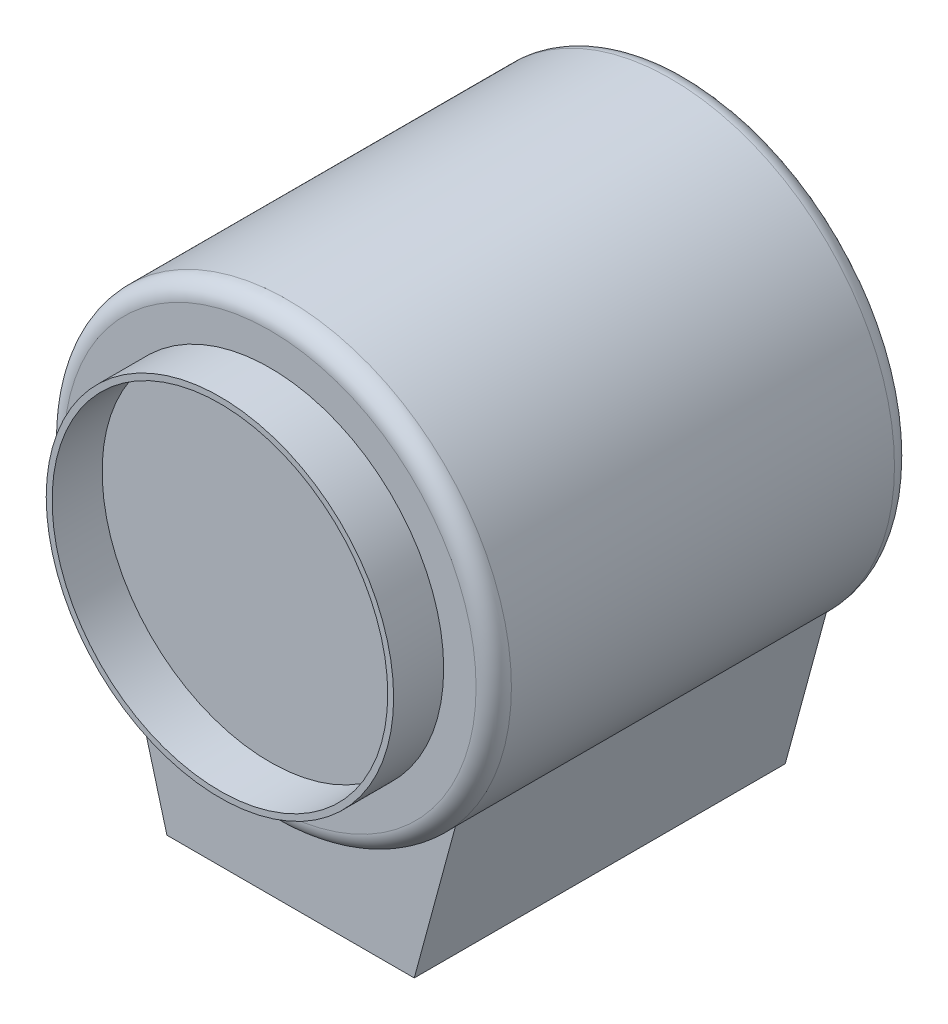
ISO-10303-21;
HEADER;
FILE_DESCRIPTION(('STEP AP214'),'2;1');
FILE_NAME('part.step','',(''),(''),'','','');
FILE_SCHEMA(('AUTOMOTIVE_DESIGN { 1 0 10303 214 1 1 1 1 }'));
ENDSEC;
DATA;
#1=APPLICATION_CONTEXT('core data for automotive mechanical design processes');
#2=APPLICATION_PROTOCOL_DEFINITION('international standard','automotive_design',2000,#1);
#3=PRODUCT_CONTEXT('',#1,'mechanical');
#4=PRODUCT('Part','Part','',(#3));
#5=PRODUCT_RELATED_PRODUCT_CATEGORY('part','',(#4));
#6=PRODUCT_DEFINITION_FORMATION('','',#4);
#7=PRODUCT_DEFINITION_CONTEXT('part definition',#1,'design');
#8=PRODUCT_DEFINITION('design','',#6,#7);
#9=PRODUCT_DEFINITION_SHAPE('','',#8);
#10=(LENGTH_UNIT() NAMED_UNIT(*) SI_UNIT(.MILLI.,.METRE.));
#11=(NAMED_UNIT(*) PLANE_ANGLE_UNIT() SI_UNIT($,.RADIAN.));
#12=(NAMED_UNIT(*) SI_UNIT($,.STERADIAN.) SOLID_ANGLE_UNIT());
#13=UNCERTAINTY_MEASURE_WITH_UNIT(LENGTH_MEASURE(1.E-05),#10,'distance_accuracy_value','');
#14=(GEOMETRIC_REPRESENTATION_CONTEXT(3) GLOBAL_UNCERTAINTY_ASSIGNED_CONTEXT((#13)) GLOBAL_UNIT_ASSIGNED_CONTEXT((#10,
#11,#12)) REPRESENTATION_CONTEXT('',''));
#15=CARTESIAN_POINT('',(0.,0.,0.));
#16=DIRECTION('',(0.,0.,1.));
#17=DIRECTION('',(1.,0.,0.));
#18=AXIS2_PLACEMENT_3D('',#15,#16,#17);
#19=CARTESIAN_POINT('',(0.,0.,222.25));
#20=DIRECTION('',(0.,0.,1.));
#21=DIRECTION('',(1.,0.,0.));
#22=AXIS2_PLACEMENT_3D('',#19,#20,#21);
#23=PLANE('',#22);
#24=CARTESIAN_POINT('',(0.,0.,222.25));
#25=DIRECTION('',(0.,0.,1.));
#26=DIRECTION('',(1.,0.,0.));
#27=AXIS2_PLACEMENT_3D('',#24,#25,#26);
#28=CIRCLE('',#27,222.25);
#29=CARTESIAN_POINT('',(222.25,0.,222.25));
#30=VERTEX_POINT('',#29);
#31=EDGE_CURVE('E136',#30,#30,#28,.T.);
#32=ORIENTED_EDGE('',*,*,#31,.T.);
#33=EDGE_LOOP('',(#32));
#34=FACE_BOUND('',#33,.T.);
#35=CARTESIAN_POINT('',(0.,0.,222.25));
#36=DIRECTION('',(0.,0.,1.));
#37=DIRECTION('',(1.,0.,0.));
#38=AXIS2_PLACEMENT_3D('',#35,#36,#37);
#39=CIRCLE('',#38,187.325);
#40=CARTESIAN_POINT('',(187.325,0.,222.25));
#41=VERTEX_POINT('',#40);
#42=EDGE_CURVE('E127',#41,#41,#39,.T.);
#43=ORIENTED_EDGE('',*,*,#42,.F.);
#44=EDGE_LOOP('',(#43));
#45=FACE_BOUND('',#44,.T.);
#46=ADVANCED_FACE('F49',(#34,#45),#23,.T.);
#47=CARTESIAN_POINT('',(0.,0.,222.25));
#48=DIRECTION('',(0.,0.,-1.));
#49=DIRECTION('',(-1.,0.,0.));
#50=AXIS2_PLACEMENT_3D('',#47,#48,#49);
#51=CYLINDRICAL_SURFACE('',#50,241.3);
#52=DIRECTION('',(0.,0.,-1.));
#53=VECTOR('',#52,1.);
#54=CARTESIAN_POINT('',(-177.8,-163.134453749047,200.025));
#55=LINE('',#54,#53);
#56=CARTESIAN_POINT('',(-177.8,-163.134453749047,200.025));
#57=VERTEX_POINT('',#56);
#58=CARTESIAN_POINT('',(-177.8,-163.134453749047,-200.025));
#59=VERTEX_POINT('',#58);
#60=EDGE_CURVE('E64',#57,#59,#55,.T.);
#61=ORIENTED_EDGE('',*,*,#60,.F.);
#62=CARTESIAN_POINT('',(0.,0.,200.025));
#63=DIRECTION('',(0.,0.,-1.));
#64=DIRECTION('',(1.,0.,0.));
#65=AXIS2_PLACEMENT_3D('',#62,#63,#64);
#66=CIRCLE('',#65,241.3);
#67=CARTESIAN_POINT('',(177.8,-163.134453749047,200.025));
#68=VERTEX_POINT('',#67);
#69=EDGE_CURVE('E69',#68,#57,#66,.T.);
#70=ORIENTED_EDGE('',*,*,#69,.F.);
#71=DIRECTION('',(0.,0.,-1.));
#72=VECTOR('',#71,1.);
#73=CARTESIAN_POINT('',(177.8,-163.134453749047,200.025));
#74=LINE('',#73,#72);
#75=CARTESIAN_POINT('',(177.8,-163.134453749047,-200.025));
#76=VERTEX_POINT('',#75);
#77=EDGE_CURVE('E109',#68,#76,#74,.T.);
#78=ORIENTED_EDGE('',*,*,#77,.T.);
#79=CARTESIAN_POINT('',(0.,0.,-200.025));
#80=DIRECTION('',(0.,0.,-1.));
#81=DIRECTION('',(1.,0.,0.));
#82=AXIS2_PLACEMENT_3D('',#79,#80,#81);
#83=CIRCLE('',#82,241.3);
#84=EDGE_CURVE('E113',#76,#59,#83,.T.);
#85=ORIENTED_EDGE('',*,*,#84,.T.);
#86=EDGE_LOOP('',(#61,#70,#78,#85));
#87=FACE_BOUND('',#86,.T.);
#88=CARTESIAN_POINT('',(0.,0.,203.2));
#89=DIRECTION('',(0.,0.,1.));
#90=DIRECTION('',(1.,0.,0.));
#91=AXIS2_PLACEMENT_3D('',#88,#89,#90);
#92=CIRCLE('',#91,241.3);
#93=CARTESIAN_POINT('',(241.3,0.,203.2));
#94=VERTEX_POINT('',#93);
#95=EDGE_CURVE('E142',#94,#94,#92,.F.);
#96=ORIENTED_EDGE('',*,*,#95,.T.);
#97=EDGE_LOOP('',(#96));
#98=FACE_BOUND('',#97,.T.);
#99=CARTESIAN_POINT('',(0.,0.,-209.891027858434));
#100=DIRECTION('',(0.,0.,1.));
#101=DIRECTION('',(1.,0.,0.));
#102=AXIS2_PLACEMENT_3D('',#99,#100,#101);
#103=CIRCLE('',#102,241.3);
#104=CARTESIAN_POINT('',(241.3,0.,-209.891027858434));
#105=VERTEX_POINT('',#104);
#106=EDGE_CURVE('E139',#105,#105,#103,.T.);
#107=ORIENTED_EDGE('',*,*,#106,.T.);
#108=EDGE_LOOP('',(#107));
#109=FACE_BOUND('',#108,.T.);
#110=ADVANCED_FACE('F164',(#87,#98,#109),#51,.T.);
#111=CARTESIAN_POINT('',(0.,0.,-273.05));
#112=DIRECTION('',(0.,0.,-1.));
#113=DIRECTION('',(-1.,0.,0.));
#114=AXIS2_PLACEMENT_3D('',#111,#112,#113);
#115=PLANE('',#114);
#116=CARTESIAN_POINT('',(0.,0.,-273.05));
#117=DIRECTION('',(0.,0.,-1.));
#118=DIRECTION('',(-1.,0.,0.));
#119=AXIS2_PLACEMENT_3D('',#116,#117,#118);
#120=CIRCLE('',#119,47.6249999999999);
#121=CARTESIAN_POINT('',(-47.6250000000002,0.,-273.05));
#122=VERTEX_POINT('',#121);
#123=EDGE_CURVE('E131',#122,#122,#120,.T.);
#124=ORIENTED_EDGE('',*,*,#123,.T.);
#125=EDGE_LOOP('',(#124));
#126=FACE_BOUND('',#125,.T.);
#127=ADVANCED_FACE('F171',(#126),#115,.T.);
#128=CARTESIAN_POINT('',(0.,0.,303.11328125));
#129=DIRECTION('',(0.,0.,-1.));
#130=DIRECTION('',(-1.,0.,0.));
#131=AXIS2_PLACEMENT_3D('',#128,#129,#130);
#132=SPHERICAL_SURFACE('',#131,578.128244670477);
#133=CARTESIAN_POINT('',(0.,0.,-227.371107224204));
#134=DIRECTION('',(0.,0.,1.));
#135=DIRECTION('',(1.,0.,0.));
#136=AXIS2_PLACEMENT_3D('',#133,#134,#135);
#137=CIRCLE('',#136,229.82293373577);
#138=CARTESIAN_POINT('',(-229.822933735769,0.,-227.371107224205));
#139=VERTEX_POINT('',#138);
#140=EDGE_CURVE('E57',#139,#139,#137,.F.);
#141=CARTESIAN_POINT('',(-229.822933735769,0.,-227.371107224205));
#142=CARTESIAN_POINT('',(-228.019555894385,0.,-228.15238903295));
#143=CARTESIAN_POINT('',(-226.212193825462,0.,-228.924474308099));
#144=CARTESIAN_POINT('',(-222.589689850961,0.,-230.45017300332));
#145=CARTESIAN_POINT('',(-220.774547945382,0.,-231.203786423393));
#146=CARTESIAN_POINT('',(-217.136672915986,0.,-232.692462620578));
#147=CARTESIAN_POINT('',(-215.313939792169,0.,-233.427525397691));
#148=CARTESIAN_POINT('',(-211.661071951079,0.,-234.87902396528));
#149=CARTESIAN_POINT('',(-209.830937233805,0.,-235.595459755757));
#150=CARTESIAN_POINT('',(-206.163456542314,0.,-237.009629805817));
#151=CARTESIAN_POINT('',(-204.326110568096,0.,-237.707364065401));
#152=CARTESIAN_POINT('',(-200.644398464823,0.,-239.084058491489));
#153=CARTESIAN_POINT('',(-198.800032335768,0.,-239.763018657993));
#154=CARTESIAN_POINT('',(-195.104471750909,0.,-241.102094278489));
#155=CARTESIAN_POINT('',(-193.253277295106,0.,-241.76220973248));
#156=CARTESIAN_POINT('',(-189.544252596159,0.,-243.063527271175));
#157=CARTESIAN_POINT('',(-187.686422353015,0.,-243.704729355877));
#158=CARTESIAN_POINT('',(-183.964319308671,0.,-244.968153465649));
#159=CARTESIAN_POINT('',(-182.100046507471,0.,-245.590375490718));
#160=CARTESIAN_POINT('',(-178.365252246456,0.,-246.815774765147));
#161=CARTESIAN_POINT('',(-176.494730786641,0.,-247.418952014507));
#162=CARTESIAN_POINT('',(-172.747633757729,0.,-248.606199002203));
#163=CARTESIAN_POINT('',(-170.871058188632,0.,-249.19026874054));
#164=CARTESIAN_POINT('',(-167.112048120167,0.,-250.339239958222));
#165=CARTESIAN_POINT('',(-165.229613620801,0.,-250.904141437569));
#166=CARTESIAN_POINT('',(-161.459081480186,0.,-252.014717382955));
#167=CARTESIAN_POINT('',(-159.570983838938,0.,-252.560391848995));
#168=CARTESIAN_POINT('',(-155.789321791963,0.,-253.632457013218));
#169=CARTESIAN_POINT('',(-153.895757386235,0.,-254.158847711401));
#170=CARTESIAN_POINT('',(-150.103358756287,0.,-255.192290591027));
#171=CARTESIAN_POINT('',(-148.204524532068,0.,-255.69934277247));
#172=CARTESIAN_POINT('',(-144.401783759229,0.,-256.694055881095));
#173=CARTESIAN_POINT('',(-142.497877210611,0.,-257.181716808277));
#174=CARTESIAN_POINT('',(-138.685189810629,0.,-258.137596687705));
#175=CARTESIAN_POINT('',(-136.776408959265,0.,-258.605815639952));
#176=CARTESIAN_POINT('',(-132.954171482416,0.,-259.522762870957));
#177=CARTESIAN_POINT('',(-131.040714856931,0.,-259.971491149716));
#178=CARTESIAN_POINT('',(-127.209324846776,0.,-260.849410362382));
#179=CARTESIAN_POINT('',(-125.291391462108,0.,-261.278601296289));
#180=CARTESIAN_POINT('',(-121.451247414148,0.,-262.117401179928));
#181=CARTESIAN_POINT('',(-119.529036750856,0.,-262.527010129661));
#182=CARTESIAN_POINT('',(-115.68053807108,0.,-263.326603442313));
#183=CARTESIAN_POINT('',(-113.754250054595,0.,-263.716587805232));
#184=CARTESIAN_POINT('',(-109.897797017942,0.,-264.476891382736));
#185=CARTESIAN_POINT('',(-107.967631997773,0.,-264.84721059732));
#186=CARTESIAN_POINT('',(-104.103625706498,0.,-265.568145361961));
#187=CARTESIAN_POINT('',(-102.169784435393,0.,-265.918760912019));
#188=CARTESIAN_POINT('',(-98.2986267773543,0.,-266.60025188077));
#189=CARTESIAN_POINT('',(-96.3613103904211,0.,-266.931127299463));
#190=CARTESIAN_POINT('',(-92.4834039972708,0.,-267.573103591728));
#191=CARTESIAN_POINT('',(-90.5428139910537,0.,-267.8842044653));
#192=CARTESIAN_POINT('',(-86.6585621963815,0.,-268.486599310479));
#193=CARTESIAN_POINT('',(-84.7149004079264,0.,-268.777893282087));
#194=CARTESIAN_POINT('',(-80.8247072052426,0.,-269.340644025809));
#195=CARTESIAN_POINT('',(-78.878175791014,0.,-269.612100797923));
#196=CARTESIAN_POINT('',(-74.9824457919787,0.,-270.135148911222));
#197=CARTESIAN_POINT('',(-73.0332472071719,0.,-270.386740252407));
#198=CARTESIAN_POINT('',(-69.1323855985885,0.,-270.870031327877));
#199=CARTESIAN_POINT('',(-67.1807225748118,0.,-271.101731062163));
#200=CARTESIAN_POINT('',(-63.2751350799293,0.,-271.545214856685));
#201=CARTESIAN_POINT('',(-61.3212106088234,0.,-271.756998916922));
#202=CARTESIAN_POINT('',(-57.4113034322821,0.,-272.160629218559));
#203=CARTESIAN_POINT('',(-55.4553207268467,0.,-272.352475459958));
#204=CARTESIAN_POINT('',(-51.5415005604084,0.,-272.716210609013));
#205=CARTESIAN_POINT('',(-49.5836630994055,0.,-272.888099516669));
#206=CARTESIAN_POINT('',(-47.6250000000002,0.,-273.05));
#207=B_SPLINE_CURVE_WITH_KNOTS('',3,(#141,#142,#143,#144,#145,#146,#147,#148,#149,#150,#151,
#152,#153,#154,#155,#156,#157,#158,#159,#160,#161,#162,#163,#164,#165,#166,#167,#168,#169,#170,
#171,#172,#173,#174,#175,#176,#177,#178,#179,#180,#181,#182,#183,#184,#185,#186,#187,#188,#189,
#190,#191,#192,#193,#194,#195,#196,#197,#198,#199,#200,#201,#202,#203,#204,#205,#206),
.UNSPECIFIED.,.F.,.F.,(4,2,2,2,2,2,2,2,2,2,2,2,2,2,2,2,2,2,2,2,2,2,2,2,2,2,2,2,2,2,2,2,4),(0.,
5.8960032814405,11.7920065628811,17.6880098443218,23.5840131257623,29.4800164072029,
35.3760196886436,41.2720229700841,47.1680262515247,53.0640295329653,58.9600328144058,
64.8560360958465,70.7520393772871,76.6480426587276,82.5440459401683,88.4400492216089,
94.3360525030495,100.23205578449,106.128059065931,112.024062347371,117.920065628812,
123.816068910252,129.712072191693,135.608075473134,141.504078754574,147.400082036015,
153.296085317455,159.192088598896,165.088091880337,170.984095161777,176.880098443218,
182.776101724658,188.672105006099),.UNSPECIFIED.);
#208=EDGE_CURVE('BSEAM147',#139,#122,#207,.T.);
#209=ORIENTED_EDGE('',*,*,#140,.T.);
#210=ORIENTED_EDGE('',*,*,#123,.F.);
#211=ORIENTED_EDGE('',*,*,#208,.T.);
#212=ORIENTED_EDGE('',*,*,#208,.F.);
#213=EDGE_LOOP('',(#209,#211,#210,#212));
#214=FACE_BOUND('',#213,.T.);
#215=ADVANCED_FACE('F147',(#214),#132,.T.);
#216=CARTESIAN_POINT('',(0.,0.,203.2));
#217=DIRECTION('',(0.,0.,1.));
#218=DIRECTION('',(1.,0.,0.));
#219=AXIS2_PLACEMENT_3D('',#216,#217,#218);
#220=TOROIDAL_SURFACE('',#219,222.25,19.05);
#221=ORIENTED_EDGE('',*,*,#95,.F.);
#222=EDGE_LOOP('',(#221));
#223=FACE_BOUND('',#222,.T.);
#224=ORIENTED_EDGE('',*,*,#31,.F.);
#225=EDGE_LOOP('',(#224));
#226=FACE_BOUND('',#225,.T.);
#227=ADVANCED_FACE('F152',(#223,#226),#220,.T.);
#228=CARTESIAN_POINT('',(0.,0.,-209.891027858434));
#229=DIRECTION('',(0.,0.,1.));
#230=DIRECTION('',(1.,0.,0.));
#231=AXIS2_PLACEMENT_3D('',#228,#229,#230);
#232=TOROIDAL_SURFACE('',#231,222.25,19.05);
#233=ORIENTED_EDGE('',*,*,#106,.F.);
#234=EDGE_LOOP('',(#233));
#235=FACE_BOUND('',#234,.T.);
#236=ORIENTED_EDGE('',*,*,#140,.F.);
#237=EDGE_LOOP('',(#236));
#238=FACE_BOUND('',#237,.T.);
#239=ADVANCED_FACE('F51',(#235,#238),#232,.T.);
#240=CARTESIAN_POINT('',(0.,0.,276.225));
#241=DIRECTION('',(0.,0.,1.));
#242=DIRECTION('',(1.,0.,0.));
#243=AXIS2_PLACEMENT_3D('',#240,#241,#242);
#244=PLANE('',#243);
#245=CARTESIAN_POINT('',(0.,0.,276.225));
#246=DIRECTION('',(0.,0.,1.));
#247=DIRECTION('',(1.,0.,0.));
#248=AXIS2_PLACEMENT_3D('',#245,#246,#247);
#249=CIRCLE('',#248,187.325);
#250=CARTESIAN_POINT('',(187.325,0.,276.225));
#251=VERTEX_POINT('',#250);
#252=EDGE_CURVE('E128',#251,#251,#249,.T.);
#253=ORIENTED_EDGE('',*,*,#252,.T.);
#254=EDGE_LOOP('',(#253));
#255=FACE_BOUND('',#254,.T.);
#256=CARTESIAN_POINT('',(0.,0.,276.225));
#257=DIRECTION('',(0.,0.,1.));
#258=DIRECTION('',(1.,0.,0.));
#259=AXIS2_PLACEMENT_3D('',#256,#257,#258);
#260=CIRCLE('',#259,180.975);
#261=CARTESIAN_POINT('',(180.975,0.,276.225));
#262=VERTEX_POINT('',#261);
#263=EDGE_CURVE('E124',#262,#262,#260,.T.);
#264=ORIENTED_EDGE('',*,*,#263,.F.);
#265=EDGE_LOOP('',(#264));
#266=FACE_BOUND('',#265,.T.);
#267=ADVANCED_FACE('F151',(#255,#266),#244,.T.);
#268=CARTESIAN_POINT('',(0.,0.,276.225));
#269=DIRECTION('',(0.,0.,-1.));
#270=DIRECTION('',(-1.,0.,0.));
#271=AXIS2_PLACEMENT_3D('',#268,#269,#270);
#272=CYLINDRICAL_SURFACE('',#271,187.325);
#273=ORIENTED_EDGE('',*,*,#252,.F.);
#274=EDGE_LOOP('',(#273));
#275=FACE_BOUND('',#274,.T.);
#276=ORIENTED_EDGE('',*,*,#42,.T.);
#277=EDGE_LOOP('',(#276));
#278=FACE_BOUND('',#277,.T.);
#279=ADVANCED_FACE('F158',(#275,#278),#272,.T.);
#280=CARTESIAN_POINT('',(0.,0.,276.225));
#281=DIRECTION('',(0.,0.,-1.));
#282=DIRECTION('',(-1.,0.,0.));
#283=AXIS2_PLACEMENT_3D('',#280,#281,#282);
#284=CYLINDRICAL_SURFACE('',#283,180.975);
#285=ORIENTED_EDGE('',*,*,#263,.T.);
#286=EDGE_LOOP('',(#285));
#287=FACE_BOUND('',#286,.T.);
#288=CARTESIAN_POINT('',(0.,0.,222.25));
#289=DIRECTION('',(0.,0.,1.));
#290=DIRECTION('',(1.,0.,0.));
#291=AXIS2_PLACEMENT_3D('',#288,#289,#290);
#292=CIRCLE('',#291,180.975);
#293=CARTESIAN_POINT('',(180.975,0.,222.25));
#294=VERTEX_POINT('',#293);
#295=EDGE_CURVE('E13',#294,#294,#292,.F.);
#296=ORIENTED_EDGE('',*,*,#295,.T.);
#297=EDGE_LOOP('',(#296));
#298=FACE_BOUND('',#297,.T.);
#299=ADVANCED_FACE('F176',(#287,#298),#284,.F.);
#300=ORIENTED_EDGE('',*,*,#295,.F.);
#301=EDGE_LOOP('',(#300));
#302=FACE_BOUND('',#301,.T.);
#303=ADVANCED_FACE('F167',(#302),#23,.T.);
#304=CARTESIAN_POINT('',(-177.8,-163.134453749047,200.025));
#305=DIRECTION('',(0.965132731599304,0.261760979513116,0.));
#306=DIRECTION('',(-0.261760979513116,0.965132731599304,0.));
#307=AXIS2_PLACEMENT_3D('',#304,#305,#306);
#308=PLANE('',#307);
#309=DIRECTION('',(0.261760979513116,-0.965132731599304,0.));
#310=VECTOR('',#309,1.);
#311=CARTESIAN_POINT('',(-177.8,-163.134453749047,-200.025));
#312=LINE('',#311,#310);
#313=CARTESIAN_POINT('',(-133.35,-327.025,-200.025));
#314=VERTEX_POINT('',#313);
#315=EDGE_CURVE('E99',#59,#314,#312,.T.);
#316=ORIENTED_EDGE('',*,*,#315,.T.);
#317=DIRECTION('',(0.,0.,-1.));
#318=VECTOR('',#317,1.);
#319=CARTESIAN_POINT('',(-133.35,-327.025,200.025));
#320=LINE('',#319,#318);
#321=CARTESIAN_POINT('',(-133.35,-327.025,200.025));
#322=VERTEX_POINT('',#321);
#323=EDGE_CURVE('E96',#322,#314,#320,.T.);
#324=ORIENTED_EDGE('',*,*,#323,.F.);
#325=DIRECTION('',(0.261760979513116,-0.965132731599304,0.));
#326=VECTOR('',#325,1.);
#327=CARTESIAN_POINT('',(-177.8,-163.134453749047,200.025));
#328=LINE('',#327,#326);
#329=EDGE_CURVE('E87',#57,#322,#328,.T.);
#330=ORIENTED_EDGE('',*,*,#329,.F.);
#331=ORIENTED_EDGE('',*,*,#60,.T.);
#332=EDGE_LOOP('',(#316,#324,#330,#331));
#333=FACE_BOUND('',#332,.T.);
#334=ADVANCED_FACE('F97',(#333),#308,.F.);
#335=CARTESIAN_POINT('',(-133.35,-327.025,200.025));
#336=DIRECTION('',(0.,1.,0.));
#337=DIRECTION('',(-1.,0.,0.));
#338=AXIS2_PLACEMENT_3D('',#335,#336,#337);
#339=PLANE('',#338);
#340=DIRECTION('',(1.,0.,0.));
#341=VECTOR('',#340,1.);
#342=CARTESIAN_POINT('',(-133.35,-327.025,-200.025));
#343=LINE('',#342,#341);
#344=CARTESIAN_POINT('',(133.35,-327.025,-200.025));
#345=VERTEX_POINT('',#344);
#346=EDGE_CURVE('E116',#314,#345,#343,.T.);
#347=ORIENTED_EDGE('',*,*,#346,.T.);
#348=DIRECTION('',(0.,0.,-1.));
#349=VECTOR('',#348,1.);
#350=CARTESIAN_POINT('',(133.35,-327.025,200.025));
#351=LINE('',#350,#349);
#352=CARTESIAN_POINT('',(133.35,-327.025,200.025));
#353=VERTEX_POINT('',#352);
#354=EDGE_CURVE('E102',#353,#345,#351,.T.);
#355=ORIENTED_EDGE('',*,*,#354,.F.);
#356=DIRECTION('',(1.,0.,0.));
#357=VECTOR('',#356,1.);
#358=CARTESIAN_POINT('',(-133.35,-327.025,200.025));
#359=LINE('',#358,#357);
#360=EDGE_CURVE('E91',#322,#353,#359,.T.);
#361=ORIENTED_EDGE('',*,*,#360,.F.);
#362=ORIENTED_EDGE('',*,*,#323,.T.);
#363=EDGE_LOOP('',(#347,#355,#361,#362));
#364=FACE_BOUND('',#363,.T.);
#365=ADVANCED_FACE('F104',(#364),#339,.F.);
#366=CARTESIAN_POINT('',(133.35,-327.025,200.025));
#367=DIRECTION('',(-0.965132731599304,0.261760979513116,0.));
#368=DIRECTION('',(-0.261760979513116,-0.965132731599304,0.));
#369=AXIS2_PLACEMENT_3D('',#366,#367,#368);
#370=PLANE('',#369);
#371=DIRECTION('',(0.261760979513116,0.965132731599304,0.));
#372=VECTOR('',#371,1.);
#373=CARTESIAN_POINT('',(133.35,-327.025,-200.025));
#374=LINE('',#373,#372);
#375=EDGE_CURVE('E118',#345,#76,#374,.T.);
#376=ORIENTED_EDGE('',*,*,#375,.T.);
#377=ORIENTED_EDGE('',*,*,#77,.F.);
#378=DIRECTION('',(0.261760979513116,0.965132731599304,0.));
#379=VECTOR('',#378,1.);
#380=CARTESIAN_POINT('',(133.35,-327.025,200.025));
#381=LINE('',#380,#379);
#382=EDGE_CURVE('E107',#353,#68,#381,.T.);
#383=ORIENTED_EDGE('',*,*,#382,.F.);
#384=ORIENTED_EDGE('',*,*,#354,.T.);
#385=EDGE_LOOP('',(#376,#377,#383,#384));
#386=FACE_BOUND('',#385,.T.);
#387=ADVANCED_FACE('F268',(#386),#370,.F.);
#388=CARTESIAN_POINT('',(0.,0.,200.025));
#389=DIRECTION('',(0.,0.,1.));
#390=DIRECTION('',(1.,0.,0.));
#391=AXIS2_PLACEMENT_3D('',#388,#389,#390);
#392=PLANE('',#391);
#393=ORIENTED_EDGE('',*,*,#69,.T.);
#394=ORIENTED_EDGE('',*,*,#329,.T.);
#395=ORIENTED_EDGE('',*,*,#360,.T.);
#396=ORIENTED_EDGE('',*,*,#382,.T.);
#397=EDGE_LOOP('',(#393,#394,#395,#396));
#398=FACE_BOUND('',#397,.T.);
#399=ADVANCED_FACE('F89',(#398),#392,.T.);
#400=CARTESIAN_POINT('',(0.,0.,-200.025));
#401=DIRECTION('',(0.,0.,1.));
#402=DIRECTION('',(1.,0.,0.));
#403=AXIS2_PLACEMENT_3D('',#400,#401,#402);
#404=PLANE('',#403);
#405=ORIENTED_EDGE('',*,*,#84,.F.);
#406=ORIENTED_EDGE('',*,*,#375,.F.);
#407=ORIENTED_EDGE('',*,*,#346,.F.);
#408=ORIENTED_EDGE('',*,*,#315,.F.);
#409=EDGE_LOOP('',(#405,#406,#407,#408));
#410=FACE_BOUND('',#409,.T.);
#411=ADVANCED_FACE('F286',(#410),#404,.F.);
#412=CLOSED_SHELL('',(#46,#110,#127,#215,#227,#239,#267,#279,#299,#303,#334,#365,#387,#399,#411));
#413=MANIFOLD_SOLID_BREP('B2',#412);
#414=ADVANCED_BREP_SHAPE_REPRESENTATION('',(#18,#413),#14);
#415=SHAPE_DEFINITION_REPRESENTATION(#9,#414);
ENDSEC;
END-ISO-10303-21;
